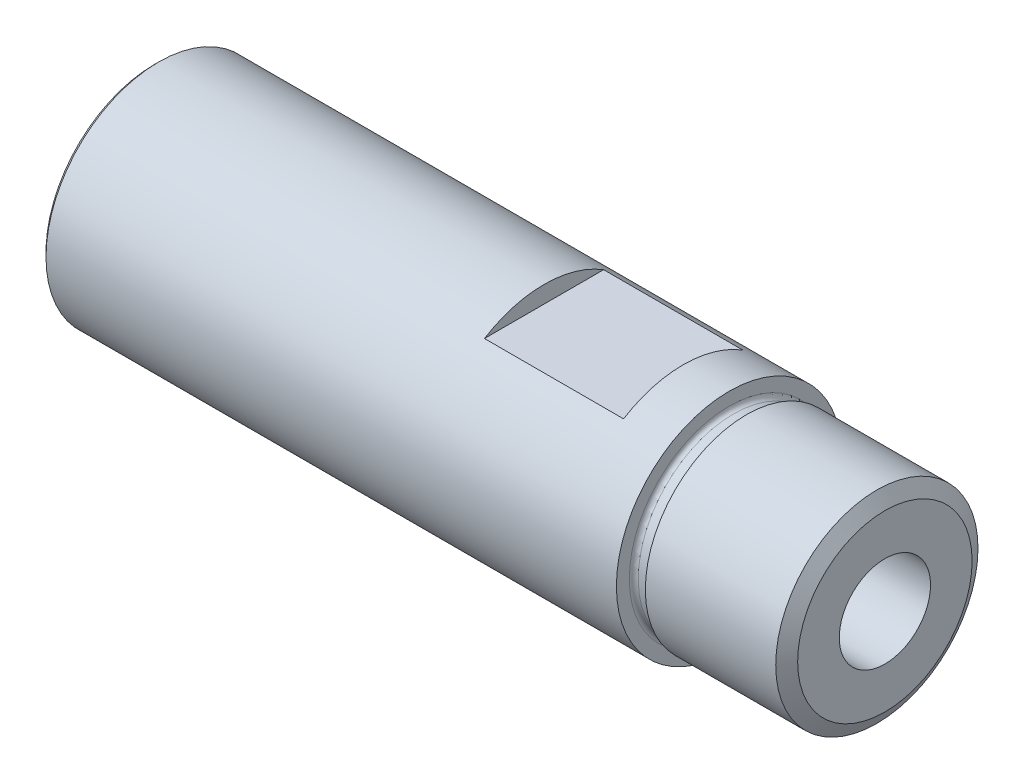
ISO-10303-21;
HEADER;
FILE_DESCRIPTION(('STEP AP214'),'2;1');
FILE_NAME('part.step','',(''),(''),'','','');
FILE_SCHEMA(('AUTOMOTIVE_DESIGN { 1 0 10303 214 1 1 1 1 }'));
ENDSEC;
DATA;
#1=APPLICATION_CONTEXT('core data for automotive mechanical design processes');
#2=APPLICATION_PROTOCOL_DEFINITION('international standard','automotive_design',2000,#1);
#3=PRODUCT_CONTEXT('',#1,'mechanical');
#4=PRODUCT('Part','Part','',(#3));
#5=PRODUCT_RELATED_PRODUCT_CATEGORY('part','',(#4));
#6=PRODUCT_DEFINITION_FORMATION('','',#4);
#7=PRODUCT_DEFINITION_CONTEXT('part definition',#1,'design');
#8=PRODUCT_DEFINITION('design','',#6,#7);
#9=PRODUCT_DEFINITION_SHAPE('','',#8);
#10=(LENGTH_UNIT() NAMED_UNIT(*) SI_UNIT(.MILLI.,.METRE.));
#11=(NAMED_UNIT(*) PLANE_ANGLE_UNIT() SI_UNIT($,.RADIAN.));
#12=(NAMED_UNIT(*) SI_UNIT($,.STERADIAN.) SOLID_ANGLE_UNIT());
#13=UNCERTAINTY_MEASURE_WITH_UNIT(LENGTH_MEASURE(1.E-05),#10,'distance_accuracy_value','');
#14=(GEOMETRIC_REPRESENTATION_CONTEXT(3) GLOBAL_UNCERTAINTY_ASSIGNED_CONTEXT((#13)) GLOBAL_UNIT_ASSIGNED_CONTEXT((#10,
#11,#12)) REPRESENTATION_CONTEXT('',''));
#15=CARTESIAN_POINT('',(0.,0.,0.));
#16=DIRECTION('',(0.,0.,1.));
#17=DIRECTION('',(1.,0.,0.));
#18=AXIS2_PLACEMENT_3D('',#15,#16,#17);
#19=CARTESIAN_POINT('',(133.35,20.574,0.));
#20=DIRECTION('',(1.,0.,0.));
#21=DIRECTION('',(0.,1.,0.));
#22=AXIS2_PLACEMENT_3D('',#19,#20,#21);
#23=PLANE('',#22);
#24=CARTESIAN_POINT('',(133.35,0.,0.));
#25=DIRECTION('',(1.,0.,0.));
#26=DIRECTION('',(0.,1.,0.));
#27=AXIS2_PLACEMENT_3D('',#24,#25,#26);
#28=CIRCLE('',#27,15.9258);
#29=CARTESIAN_POINT('',(133.35,15.9258,0.));
#30=VERTEX_POINT('',#29);
#31=EDGE_CURVE('E112',#30,#30,#28,.T.);
#32=ORIENTED_EDGE('',*,*,#31,.T.);
#33=EDGE_LOOP('',(#32));
#34=FACE_BOUND('',#33,.T.);
#35=CARTESIAN_POINT('',(133.35,0.,0.));
#36=DIRECTION('',(1.,0.,0.));
#37=DIRECTION('',(0.,0.,-1.));
#38=AXIS2_PLACEMENT_3D('',#35,#36,#37);
#39=CIRCLE('',#38,8.33374);
#40=CARTESIAN_POINT('',(133.35,0.,-8.33374));
#41=VERTEX_POINT('',#40);
#42=EDGE_CURVE('E184',#41,#41,#39,.T.);
#43=ORIENTED_EDGE('',*,*,#42,.F.);
#44=EDGE_LOOP('',(#43));
#45=FACE_BOUND('',#44,.T.);
#46=ADVANCED_FACE('F42',(#34,#45),#23,.T.);
#47=CARTESIAN_POINT('',(41.148,0.,0.));
#48=DIRECTION('',(-1.,0.,0.));
#49=DIRECTION('',(0.,0.,1.));
#50=AXIS2_PLACEMENT_3D('',#47,#48,#49);
#51=CONICAL_SURFACE('',#50,13.29563,1.02974425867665);
#52=CARTESIAN_POINT('',(41.148,0.,0.));
#53=DIRECTION('',(-1.,0.,0.));
#54=DIRECTION('',(0.,0.,1.));
#55=AXIS2_PLACEMENT_3D('',#52,#53,#54);
#56=CIRCLE('',#55,13.29563);
#57=CARTESIAN_POINT('',(41.148,0.,13.29563));
#58=VERTEX_POINT('',#57);
#59=EDGE_CURVE('E146',#58,#58,#56,.T.);
#60=ORIENTED_EDGE('',*,*,#59,.T.);
#61=EDGE_LOOP('',(#60));
#62=FACE_BOUND('',#61,.T.);
#63=CARTESIAN_POINT('',(41.2769627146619,0.,0.));
#64=DIRECTION('',(-1.,0.,0.));
#65=DIRECTION('',(0.,0.,1.));
#66=AXIS2_PLACEMENT_3D('',#63,#64,#65);
#67=CIRCLE('',#66,13.081);
#68=CARTESIAN_POINT('',(41.2769627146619,0.,13.081));
#69=VERTEX_POINT('',#68);
#70=EDGE_CURVE('E147',#69,#69,#67,.T.);
#71=ORIENTED_EDGE('',*,*,#70,.F.);
#72=EDGE_LOOP('',(#71));
#73=FACE_BOUND('',#72,.T.);
#74=ADVANCED_FACE('F206',(#62,#73),#51,.F.);
#75=CARTESIAN_POINT('',(0.,0.,0.));
#76=DIRECTION('',(-1.,0.,0.));
#77=DIRECTION('',(0.,-1.,0.));
#78=AXIS2_PLACEMENT_3D('',#75,#76,#77);
#79=PLANE('',#78);
#80=CARTESIAN_POINT('',(0.,0.,0.));
#81=DIRECTION('',(-1.,0.,0.));
#82=DIRECTION('',(0.,-1.,0.));
#83=AXIS2_PLACEMENT_3D('',#80,#81,#82);
#84=CIRCLE('',#83,19.812);
#85=CARTESIAN_POINT('',(0.,19.812,0.));
#86=VERTEX_POINT('',#85);
#87=EDGE_CURVE('E106',#86,#86,#84,.T.);
#88=ORIENTED_EDGE('',*,*,#87,.T.);
#89=EDGE_LOOP('',(#88));
#90=FACE_BOUND('',#89,.T.);
#91=CARTESIAN_POINT('',(0.,0.,0.));
#92=DIRECTION('',(-1.,0.,0.));
#93=DIRECTION('',(0.,-1.,0.));
#94=AXIS2_PLACEMENT_3D('',#91,#92,#93);
#95=CIRCLE('',#94,15.561081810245);
#96=CARTESIAN_POINT('',(0.,-15.561081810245,0.));
#97=VERTEX_POINT('',#96);
#98=EDGE_CURVE('E118',#97,#97,#95,.F.);
#99=ORIENTED_EDGE('',*,*,#98,.T.);
#100=EDGE_LOOP('',(#99));
#101=FACE_BOUND('',#100,.T.);
#102=ADVANCED_FACE('F44',(#90,#101),#79,.T.);
#103=CARTESIAN_POINT('',(133.35,0.,0.));
#104=DIRECTION('',(1.,0.,0.));
#105=DIRECTION('',(0.,1.,0.));
#106=AXIS2_PLACEMENT_3D('',#103,#104,#105);
#107=CYLINDRICAL_SURFACE('',#106,20.574);
#108=CARTESIAN_POINT('',(71.12,0.,0.));
#109=DIRECTION('',(-1.,0.,0.));
#110=DIRECTION('',(0.,0.,1.));
#111=AXIS2_PLACEMENT_3D('',#108,#109,#110);
#112=CIRCLE('',#111,20.574);
#113=CARTESIAN_POINT('',(71.12,-17.4625,10.8789048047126));
#114=VERTEX_POINT('',#113);
#115=CARTESIAN_POINT('',(71.12,-17.4625,-10.8789048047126));
#116=VERTEX_POINT('',#115);
#117=EDGE_CURVE('E12',#114,#116,#112,.F.);
#118=ORIENTED_EDGE('',*,*,#117,.F.);
#119=DIRECTION('',(1.,0.,0.));
#120=VECTOR('',#119,1.);
#121=CARTESIAN_POINT('',(133.35,-17.4625,10.8789048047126));
#122=LINE('',#121,#120);
#123=CARTESIAN_POINT('',(96.52,-17.4625,10.8789048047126));
#124=VERTEX_POINT('',#123);
#125=EDGE_CURVE('E50',#124,#114,#122,.F.);
#126=ORIENTED_EDGE('',*,*,#125,.F.);
#127=CARTESIAN_POINT('',(96.52,0.,0.));
#128=DIRECTION('',(1.,0.,0.));
#129=DIRECTION('',(0.,0.,-1.));
#130=AXIS2_PLACEMENT_3D('',#127,#128,#129);
#131=CIRCLE('',#130,20.574);
#132=CARTESIAN_POINT('',(96.52,-17.4625,-10.8789048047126));
#133=VERTEX_POINT('',#132);
#134=EDGE_CURVE('E80',#133,#124,#131,.F.);
#135=ORIENTED_EDGE('',*,*,#134,.F.);
#136=DIRECTION('',(1.,0.,0.));
#137=VECTOR('',#136,1.);
#138=CARTESIAN_POINT('',(133.35,-17.4625,-10.8789048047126));
#139=LINE('',#138,#137);
#140=EDGE_CURVE('E85',#116,#133,#139,.T.);
#141=ORIENTED_EDGE('',*,*,#140,.F.);
#142=EDGE_LOOP('',(#118,#126,#135,#141));
#143=FACE_BOUND('',#142,.T.);
#144=DIRECTION('',(1.,0.,0.));
#145=VECTOR('',#144,1.);
#146=CARTESIAN_POINT('',(133.35,17.4625,-10.8789048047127));
#147=LINE('',#146,#145);
#148=CARTESIAN_POINT('',(96.52,17.4625,-10.8789048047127));
#149=VERTEX_POINT('',#148);
#150=CARTESIAN_POINT('',(71.12,17.4625,-10.8789048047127));
#151=VERTEX_POINT('',#150);
#152=EDGE_CURVE('E86',#149,#151,#147,.F.);
#153=ORIENTED_EDGE('',*,*,#152,.F.);
#154=CARTESIAN_POINT('',(96.52,0.,0.));
#155=DIRECTION('',(1.,0.,0.));
#156=DIRECTION('',(0.,0.,-1.));
#157=AXIS2_PLACEMENT_3D('',#154,#155,#156);
#158=CIRCLE('',#157,20.574);
#159=CARTESIAN_POINT('',(96.52,17.4625,10.8789048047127));
#160=VERTEX_POINT('',#159);
#161=EDGE_CURVE('E102',#160,#149,#158,.F.);
#162=ORIENTED_EDGE('',*,*,#161,.F.);
#163=DIRECTION('',(1.,0.,0.));
#164=VECTOR('',#163,1.);
#165=CARTESIAN_POINT('',(133.35,17.4625,10.8789048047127));
#166=LINE('',#165,#164);
#167=CARTESIAN_POINT('',(71.12,17.4625,10.8789048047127));
#168=VERTEX_POINT('',#167);
#169=EDGE_CURVE('E104',#168,#160,#166,.T.);
#170=ORIENTED_EDGE('',*,*,#169,.F.);
#171=CARTESIAN_POINT('',(71.12,0.,0.));
#172=DIRECTION('',(-1.,0.,0.));
#173=DIRECTION('',(0.,0.,1.));
#174=AXIS2_PLACEMENT_3D('',#171,#172,#173);
#175=CIRCLE('',#174,20.574);
#176=EDGE_CURVE('E100',#151,#168,#175,.F.);
#177=ORIENTED_EDGE('',*,*,#176,.F.);
#178=EDGE_LOOP('',(#153,#162,#170,#177));
#179=FACE_BOUND('',#178,.T.);
#180=CARTESIAN_POINT('',(0.762000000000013,0.,0.));
#181=DIRECTION('',(-1.,0.,0.));
#182=DIRECTION('',(0.,-1.,0.));
#183=AXIS2_PLACEMENT_3D('',#180,#181,#182);
#184=CIRCLE('',#183,20.574);
#185=CARTESIAN_POINT('',(0.762000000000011,20.574,0.));
#186=VERTEX_POINT('',#185);
#187=EDGE_CURVE('E109',#186,#186,#184,.F.);
#188=ORIENTED_EDGE('',*,*,#187,.T.);
#189=EDGE_LOOP('',(#188));
#190=FACE_BOUND('',#189,.T.);
#191=CARTESIAN_POINT('',(104.902,0.,0.));
#192=DIRECTION('',(-1.,0.,0.));
#193=DIRECTION('',(0.,-1.,0.));
#194=AXIS2_PLACEMENT_3D('',#191,#192,#193);
#195=CIRCLE('',#194,20.574);
#196=CARTESIAN_POINT('',(104.902,-20.574,0.));
#197=VERTEX_POINT('',#196);
#198=EDGE_CURVE('E136',#197,#197,#195,.F.);
#199=ORIENTED_EDGE('',*,*,#198,.F.);
#200=EDGE_LOOP('',(#199));
#201=FACE_BOUND('',#200,.T.);
#202=ADVANCED_FACE('F95',(#143,#179,#190,#201),#107,.T.);
#203=CARTESIAN_POINT('',(14.5928680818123,0.,0.));
#204=DIRECTION('',(-1.,0.,0.));
#205=DIRECTION('',(0.,-1.,0.));
#206=AXIS2_PLACEMENT_3D('',#203,#204,#205);
#207=CONICAL_SURFACE('',#206,12.7883319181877,0.785398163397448);
#208=CARTESIAN_POINT('',(12.7,0.,0.));
#209=DIRECTION('',(1.,0.,0.));
#210=DIRECTION('',(0.,1.,0.));
#211=AXIS2_PLACEMENT_3D('',#208,#209,#210);
#212=CIRCLE('',#211,14.6812);
#213=CARTESIAN_POINT('',(12.7,14.6812,0.));
#214=VERTEX_POINT('',#213);
#215=EDGE_CURVE('E150',#214,#214,#212,.T.);
#216=ORIENTED_EDGE('',*,*,#215,.F.);
#217=EDGE_LOOP('',(#216));
#218=FACE_BOUND('',#217,.T.);
#219=CARTESIAN_POINT('',(14.08557,0.,0.));
#220=DIRECTION('',(-1.,0.,0.));
#221=DIRECTION('',(0.,-1.,0.));
#222=AXIS2_PLACEMENT_3D('',#219,#220,#221);
#223=CIRCLE('',#222,13.29563);
#224=CARTESIAN_POINT('',(14.08557,-13.29563,0.));
#225=VERTEX_POINT('',#224);
#226=EDGE_CURVE('E152',#225,#225,#223,.T.);
#227=ORIENTED_EDGE('',*,*,#226,.F.);
#228=EDGE_LOOP('',(#227));
#229=FACE_BOUND('',#228,.T.);
#230=ADVANCED_FACE('F218',(#218,#229),#207,.F.);
#231=CARTESIAN_POINT('',(14.5928680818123,0.,0.));
#232=DIRECTION('',(1.,0.,0.));
#233=DIRECTION('',(0.,1.,0.));
#234=AXIS2_PLACEMENT_3D('',#231,#232,#233);
#235=CYLINDRICAL_SURFACE('',#234,14.6812);
#236=CARTESIAN_POINT('',(1.52399999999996,0.,0.));
#237=DIRECTION('',(-1.,0.,0.));
#238=DIRECTION('',(0.,-1.,0.));
#239=AXIS2_PLACEMENT_3D('',#236,#237,#238);
#240=CIRCLE('',#239,14.6812);
#241=CARTESIAN_POINT('',(1.52399999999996,-14.6812,0.));
#242=VERTEX_POINT('',#241);
#243=EDGE_CURVE('E121',#242,#242,#240,.T.);
#244=ORIENTED_EDGE('',*,*,#243,.T.);
#245=EDGE_LOOP('',(#244));
#246=FACE_BOUND('',#245,.T.);
#247=ORIENTED_EDGE('',*,*,#215,.T.);
#248=EDGE_LOOP('',(#247));
#249=FACE_BOUND('',#248,.T.);
#250=ADVANCED_FACE('F223',(#246,#249),#235,.F.);
#251=CARTESIAN_POINT('',(0.,0.,0.));
#252=DIRECTION('',(-1.,0.,0.));
#253=DIRECTION('',(0.,0.,1.));
#254=AXIS2_PLACEMENT_3D('',#251,#252,#253);
#255=CYLINDRICAL_SURFACE('',#254,13.29563);
#256=ORIENTED_EDGE('',*,*,#226,.T.);
#257=EDGE_LOOP('',(#256));
#258=FACE_BOUND('',#257,.T.);
#259=ORIENTED_EDGE('',*,*,#59,.F.);
#260=EDGE_LOOP('',(#259));
#261=FACE_BOUND('',#260,.T.);
#262=ADVANCED_FACE('F216',(#258,#261),#255,.F.);
#263=CARTESIAN_POINT('',(64.516,0.,0.));
#264=DIRECTION('',(-1.,0.,0.));
#265=DIRECTION('',(0.,0.,1.));
#266=AXIS2_PLACEMENT_3D('',#263,#264,#265);
#267=CYLINDRICAL_SURFACE('',#266,13.081);
#268=CARTESIAN_POINT('',(63.754,0.,0.));
#269=DIRECTION('',(1.,0.,0.));
#270=DIRECTION('',(0.,0.,-1.));
#271=AXIS2_PLACEMENT_3D('',#268,#269,#270);
#272=CIRCLE('',#271,13.081);
#273=CARTESIAN_POINT('',(63.754,0.,-13.081));
#274=VERTEX_POINT('',#273);
#275=EDGE_CURVE('E143',#274,#274,#272,.T.);
#276=ORIENTED_EDGE('',*,*,#275,.T.);
#277=EDGE_LOOP('',(#276));
#278=FACE_BOUND('',#277,.T.);
#279=ORIENTED_EDGE('',*,*,#70,.T.);
#280=EDGE_LOOP('',(#279));
#281=FACE_BOUND('',#280,.T.);
#282=ADVANCED_FACE('F250',(#278,#281),#267,.F.);
#283=CARTESIAN_POINT('',(64.516,0.,0.));
#284=DIRECTION('',(1.,0.,0.));
#285=DIRECTION('',(0.,0.,-1.));
#286=AXIS2_PLACEMENT_3D('',#283,#284,#285);
#287=PLANE('',#286);
#288=CARTESIAN_POINT('',(64.516,0.,0.));
#289=DIRECTION('',(1.,0.,0.));
#290=DIRECTION('',(0.,0.,-1.));
#291=AXIS2_PLACEMENT_3D('',#288,#289,#290);
#292=CIRCLE('',#291,8.01623999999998);
#293=CARTESIAN_POINT('',(64.516,0.,-8.01623999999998));
#294=VERTEX_POINT('',#293);
#295=EDGE_CURVE('E124',#294,#294,#292,.T.);
#296=ORIENTED_EDGE('',*,*,#295,.T.);
#297=EDGE_LOOP('',(#296));
#298=FACE_BOUND('',#297,.T.);
#299=CARTESIAN_POINT('',(64.516,0.,0.));
#300=DIRECTION('',(1.,0.,0.));
#301=DIRECTION('',(0.,0.,-1.));
#302=AXIS2_PLACEMENT_3D('',#299,#300,#301);
#303=CIRCLE('',#302,12.319);
#304=CARTESIAN_POINT('',(64.516,0.,-12.319));
#305=VERTEX_POINT('',#304);
#306=EDGE_CURVE('E130',#305,#305,#303,.F.);
#307=ORIENTED_EDGE('',*,*,#306,.T.);
#308=EDGE_LOOP('',(#307));
#309=FACE_BOUND('',#308,.T.);
#310=ADVANCED_FACE('F256',(#298,#309),#287,.F.);
#311=CARTESIAN_POINT('',(63.754,0.,0.));
#312=DIRECTION('',(1.,0.,0.));
#313=DIRECTION('',(0.,0.,-1.));
#314=AXIS2_PLACEMENT_3D('',#311,#312,#313);
#315=TOROIDAL_SURFACE('',#314,12.319,0.762);
#316=ORIENTED_EDGE('',*,*,#306,.F.);
#317=EDGE_LOOP('',(#316));
#318=FACE_BOUND('',#317,.T.);
#319=ORIENTED_EDGE('',*,*,#275,.F.);
#320=EDGE_LOOP('',(#319));
#321=FACE_BOUND('',#320,.T.);
#322=ADVANCED_FACE('F262',(#318,#321),#315,.F.);
#323=CARTESIAN_POINT('',(64.516,0.,0.));
#324=DIRECTION('',(-1.,0.,0.));
#325=DIRECTION('',(0.,0.,1.));
#326=AXIS2_PLACEMENT_3D('',#323,#324,#325);
#327=CYLINDRICAL_SURFACE('',#326,6.74623999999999);
#328=CARTESIAN_POINT('',(65.786,0.,0.));
#329=DIRECTION('',(1.,0.,0.));
#330=DIRECTION('',(0.,0.,-1.));
#331=AXIS2_PLACEMENT_3D('',#328,#329,#330);
#332=CIRCLE('',#331,6.74623999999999);
#333=CARTESIAN_POINT('',(65.786,0.,-6.74623999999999));
#334=VERTEX_POINT('',#333);
#335=EDGE_CURVE('E127',#334,#334,#332,.F.);
#336=ORIENTED_EDGE('',*,*,#335,.T.);
#337=EDGE_LOOP('',(#336));
#338=FACE_BOUND('',#337,.T.);
#339=CARTESIAN_POINT('',(88.138,0.,0.));
#340=DIRECTION('',(-1.,0.,0.));
#341=DIRECTION('',(0.,-1.,0.));
#342=AXIS2_PLACEMENT_3D('',#339,#340,#341);
#343=CIRCLE('',#342,6.74623999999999);
#344=CARTESIAN_POINT('',(88.138,-6.74623999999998,0.));
#345=VERTEX_POINT('',#344);
#346=EDGE_CURVE('E151',#345,#345,#343,.T.);
#347=ORIENTED_EDGE('',*,*,#346,.F.);
#348=EDGE_LOOP('',(#347));
#349=FACE_BOUND('',#348,.T.);
#350=ADVANCED_FACE('F268',(#338,#349),#327,.F.);
#351=CARTESIAN_POINT('',(88.8433719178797,0.,0.));
#352=DIRECTION('',(-1.,0.,0.));
#353=DIRECTION('',(0.,-1.,0.));
#354=AXIS2_PLACEMENT_3D('',#351,#352,#353);
#355=CONICAL_SURFACE('',#354,5.52449999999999,1.04719755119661);
#356=ORIENTED_EDGE('',*,*,#346,.T.);
#357=EDGE_LOOP('',(#356));
#358=FACE_BOUND('',#357,.T.);
#359=CARTESIAN_POINT('',(88.8433719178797,0.,0.));
#360=DIRECTION('',(-1.,0.,0.));
#361=DIRECTION('',(0.,-1.,0.));
#362=AXIS2_PLACEMENT_3D('',#359,#360,#361);
#363=CIRCLE('',#362,5.52449999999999);
#364=CARTESIAN_POINT('',(88.8433719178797,-5.52449999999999,0.));
#365=VERTEX_POINT('',#364);
#366=EDGE_CURVE('E161',#365,#365,#363,.T.);
#367=ORIENTED_EDGE('',*,*,#366,.F.);
#368=EDGE_LOOP('',(#367));
#369=FACE_BOUND('',#368,.T.);
#370=ADVANCED_FACE('F272',(#358,#369),#355,.F.);
#371=CARTESIAN_POINT('',(90.1631946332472,0.,0.));
#372=DIRECTION('',(-1.,0.,0.));
#373=DIRECTION('',(0.,-1.,0.));
#374=AXIS2_PLACEMENT_3D('',#371,#372,#373);
#375=TOROIDAL_SURFACE('',#374,6.2865,1.52400000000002);
#376=ORIENTED_EDGE('',*,*,#366,.T.);
#377=EDGE_LOOP('',(#376));
#378=FACE_BOUND('',#377,.T.);
#379=CARTESIAN_POINT('',(90.1631946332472,0.,0.));
#380=DIRECTION('',(-1.,0.,0.));
#381=DIRECTION('',(0.,-1.,0.));
#382=AXIS2_PLACEMENT_3D('',#379,#380,#381);
#383=CIRCLE('',#382,4.76249999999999);
#384=CARTESIAN_POINT('',(90.1631946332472,-4.76249999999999,0.));
#385=VERTEX_POINT('',#384);
#386=EDGE_CURVE('E139',#385,#385,#383,.T.);
#387=ORIENTED_EDGE('',*,*,#386,.F.);
#388=EDGE_LOOP('',(#387));
#389=FACE_BOUND('',#388,.T.);
#390=ADVANCED_FACE('F276',(#378,#389),#375,.T.);
#391=CARTESIAN_POINT('',(0.,0.,0.));
#392=DIRECTION('',(-1.,0.,0.));
#393=DIRECTION('',(0.,-1.,0.));
#394=AXIS2_PLACEMENT_3D('',#391,#392,#393);
#395=CYLINDRICAL_SURFACE('',#394,4.76249999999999);
#396=CARTESIAN_POINT('',(108.458,0.,0.));
#397=DIRECTION('',(1.,0.,0.));
#398=DIRECTION('',(0.,1.,0.));
#399=AXIS2_PLACEMENT_3D('',#396,#397,#398);
#400=CIRCLE('',#399,4.76250000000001);
#401=CARTESIAN_POINT('',(108.458,4.76250000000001,0.));
#402=VERTEX_POINT('',#401);
#403=EDGE_CURVE('E177',#402,#402,#400,.T.);
#404=ORIENTED_EDGE('',*,*,#403,.T.);
#405=EDGE_LOOP('',(#404));
#406=FACE_BOUND('',#405,.T.);
#407=ORIENTED_EDGE('',*,*,#386,.T.);
#408=EDGE_LOOP('',(#407));
#409=FACE_BOUND('',#408,.T.);
#410=ADVANCED_FACE('F280',(#406,#409),#395,.F.);
#411=CARTESIAN_POINT('',(105.7148,0.,0.));
#412=DIRECTION('',(1.,0.,0.));
#413=DIRECTION('',(0.,1.,0.));
#414=AXIS2_PLACEMENT_3D('',#411,#412,#413);
#415=TOROIDAL_SURFACE('',#414,18.2118,0.812800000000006);
#416=CARTESIAN_POINT('',(105.7148,0.,0.));
#417=DIRECTION('',(1.,0.,0.));
#418=DIRECTION('',(0.,1.,0.));
#419=AXIS2_PLACEMENT_3D('',#416,#417,#418);
#420=CIRCLE('',#419,17.399);
#421=CARTESIAN_POINT('',(105.7148,17.399,0.));
#422=VERTEX_POINT('',#421);
#423=EDGE_CURVE('E174',#422,#422,#420,.T.);
#424=ORIENTED_EDGE('',*,*,#423,.F.);
#425=EDGE_LOOP('',(#424));
#426=FACE_BOUND('',#425,.T.);
#427=CARTESIAN_POINT('',(104.902,0.,0.));
#428=DIRECTION('',(1.,0.,0.));
#429=DIRECTION('',(0.,1.,0.));
#430=AXIS2_PLACEMENT_3D('',#427,#428,#429);
#431=CIRCLE('',#430,18.2118);
#432=CARTESIAN_POINT('',(104.902,18.2118,0.));
#433=VERTEX_POINT('',#432);
#434=EDGE_CURVE('E140',#433,#433,#431,.T.);
#435=ORIENTED_EDGE('',*,*,#434,.T.);
#436=EDGE_LOOP('',(#435));
#437=FACE_BOUND('',#436,.T.);
#438=ADVANCED_FACE('F284',(#426,#437),#415,.F.);
#439=CARTESIAN_POINT('',(104.902,21.3041670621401,0.));
#440=DIRECTION('',(-1.,0.,0.));
#441=DIRECTION('',(0.,-1.,0.));
#442=AXIS2_PLACEMENT_3D('',#439,#440,#441);
#443=PLANE('',#442);
#444=ORIENTED_EDGE('',*,*,#198,.T.);
#445=EDGE_LOOP('',(#444));
#446=FACE_BOUND('',#445,.T.);
#447=ORIENTED_EDGE('',*,*,#434,.F.);
#448=EDGE_LOOP('',(#447));
#449=FACE_BOUND('',#448,.T.);
#450=ADVANCED_FACE('F288',(#446,#449),#443,.F.);
#451=CARTESIAN_POINT('',(133.35,0.,0.));
#452=DIRECTION('',(1.,0.,0.));
#453=DIRECTION('',(0.,1.,0.));
#454=AXIS2_PLACEMENT_3D('',#451,#452,#453);
#455=CYLINDRICAL_SURFACE('',#454,18.4658);
#456=CARTESIAN_POINT('',(131.883530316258,0.,0.));
#457=DIRECTION('',(1.,0.,0.));
#458=DIRECTION('',(0.,1.,0.));
#459=AXIS2_PLACEMENT_3D('',#456,#457,#458);
#460=CIRCLE('',#459,18.4658);
#461=CARTESIAN_POINT('',(131.883530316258,18.4658,0.));
#462=VERTEX_POINT('',#461);
#463=EDGE_CURVE('E115',#462,#462,#460,.F.);
#464=ORIENTED_EDGE('',*,*,#463,.T.);
#465=EDGE_LOOP('',(#464));
#466=FACE_BOUND('',#465,.T.);
#467=CARTESIAN_POINT('',(108.077,0.,0.));
#468=DIRECTION('',(1.,0.,0.));
#469=DIRECTION('',(0.,1.,0.));
#470=AXIS2_PLACEMENT_3D('',#467,#468,#469);
#471=CIRCLE('',#470,18.4658);
#472=CARTESIAN_POINT('',(108.077,18.4658,0.));
#473=VERTEX_POINT('',#472);
#474=EDGE_CURVE('E168',#473,#473,#471,.T.);
#475=ORIENTED_EDGE('',*,*,#474,.T.);
#476=EDGE_LOOP('',(#475));
#477=FACE_BOUND('',#476,.T.);
#478=ADVANCED_FACE('F292',(#466,#477),#455,.T.);
#479=CARTESIAN_POINT('',(108.077,17.399,0.));
#480=DIRECTION('',(1.,0.,0.));
#481=DIRECTION('',(0.,1.,0.));
#482=AXIS2_PLACEMENT_3D('',#479,#480,#481);
#483=PLANE('',#482);
#484=ORIENTED_EDGE('',*,*,#474,.F.);
#485=EDGE_LOOP('',(#484));
#486=FACE_BOUND('',#485,.T.);
#487=CARTESIAN_POINT('',(108.077,0.,0.));
#488=DIRECTION('',(1.,0.,0.));
#489=DIRECTION('',(0.,1.,0.));
#490=AXIS2_PLACEMENT_3D('',#487,#488,#489);
#491=CIRCLE('',#490,17.399);
#492=CARTESIAN_POINT('',(108.077,17.399,0.));
#493=VERTEX_POINT('',#492);
#494=EDGE_CURVE('E171',#493,#493,#491,.T.);
#495=ORIENTED_EDGE('',*,*,#494,.T.);
#496=EDGE_LOOP('',(#495));
#497=FACE_BOUND('',#496,.T.);
#498=ADVANCED_FACE('F296',(#486,#497),#483,.F.);
#499=CARTESIAN_POINT('',(133.35,0.,0.));
#500=DIRECTION('',(1.,0.,0.));
#501=DIRECTION('',(0.,1.,0.));
#502=AXIS2_PLACEMENT_3D('',#499,#500,#501);
#503=CYLINDRICAL_SURFACE('',#502,17.399);
#504=ORIENTED_EDGE('',*,*,#494,.F.);
#505=EDGE_LOOP('',(#504));
#506=FACE_BOUND('',#505,.T.);
#507=ORIENTED_EDGE('',*,*,#423,.T.);
#508=EDGE_LOOP('',(#507));
#509=FACE_BOUND('',#508,.T.);
#510=ADVANCED_FACE('F300',(#506,#509),#503,.T.);
#511=CARTESIAN_POINT('',(111.633,0.,0.));
#512=DIRECTION('',(1.,0.,0.));
#513=DIRECTION('',(0.,1.,0.));
#514=AXIS2_PLACEMENT_3D('',#511,#512,#513);
#515=CONICAL_SURFACE('',#514,7.9375,0.785398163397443);
#516=ORIENTED_EDGE('',*,*,#403,.F.);
#517=EDGE_LOOP('',(#516));
#518=FACE_BOUND('',#517,.T.);
#519=CARTESIAN_POINT('',(111.633,0.,0.));
#520=DIRECTION('',(1.,0.,0.));
#521=DIRECTION('',(0.,1.,0.));
#522=AXIS2_PLACEMENT_3D('',#519,#520,#521);
#523=CIRCLE('',#522,7.9375);
#524=CARTESIAN_POINT('',(111.633,7.9375,0.));
#525=VERTEX_POINT('',#524);
#526=EDGE_CURVE('E134',#525,#525,#523,.T.);
#527=ORIENTED_EDGE('',*,*,#526,.T.);
#528=EDGE_LOOP('',(#527));
#529=FACE_BOUND('',#528,.T.);
#530=ADVANCED_FACE('F304',(#518,#529),#515,.F.);
#531=CARTESIAN_POINT('',(133.35,0.,0.));
#532=DIRECTION('',(1.,0.,0.));
#533=DIRECTION('',(0.,1.,0.));
#534=AXIS2_PLACEMENT_3D('',#531,#532,#533);
#535=CYLINDRICAL_SURFACE('',#534,7.93749999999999);
#536=CARTESIAN_POINT('',(114.061914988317,0.,0.));
#537=DIRECTION('',(1.,0.,0.));
#538=DIRECTION('',(0.,0.,-1.));
#539=AXIS2_PLACEMENT_3D('',#536,#537,#538);
#540=CIRCLE('',#539,7.93749999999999);
#541=CARTESIAN_POINT('',(114.061914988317,0.,-7.93749999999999));
#542=VERTEX_POINT('',#541);
#543=EDGE_CURVE('E131',#542,#542,#540,.T.);
#544=ORIENTED_EDGE('',*,*,#543,.T.);
#545=EDGE_LOOP('',(#544));
#546=FACE_BOUND('',#545,.T.);
#547=ORIENTED_EDGE('',*,*,#526,.F.);
#548=EDGE_LOOP('',(#547));
#549=FACE_BOUND('',#548,.T.);
#550=ADVANCED_FACE('F308',(#546,#549),#535,.F.);
#551=CARTESIAN_POINT('',(114.3,0.,0.));
#552=DIRECTION('',(1.,0.,0.));
#553=DIRECTION('',(0.,0.,-1.));
#554=AXIS2_PLACEMENT_3D('',#551,#552,#553);
#555=CONICAL_SURFACE('',#554,8.33373999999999,1.02974425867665);
#556=CARTESIAN_POINT('',(114.3,0.,0.));
#557=DIRECTION('',(1.,0.,0.));
#558=DIRECTION('',(0.,0.,-1.));
#559=AXIS2_PLACEMENT_3D('',#556,#557,#558);
#560=CIRCLE('',#559,8.33373999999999);
#561=CARTESIAN_POINT('',(114.3,0.,-8.33373999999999));
#562=VERTEX_POINT('',#561);
#563=EDGE_CURVE('E135',#562,#562,#560,.T.);
#564=ORIENTED_EDGE('',*,*,#563,.T.);
#565=EDGE_LOOP('',(#564));
#566=FACE_BOUND('',#565,.T.);
#567=ORIENTED_EDGE('',*,*,#543,.F.);
#568=EDGE_LOOP('',(#567));
#569=FACE_BOUND('',#568,.T.);
#570=ADVANCED_FACE('F312',(#566,#569),#555,.F.);
#571=CARTESIAN_POINT('',(133.35,0.,0.));
#572=DIRECTION('',(1.,0.,0.));
#573=DIRECTION('',(0.,0.,-1.));
#574=AXIS2_PLACEMENT_3D('',#571,#572,#573);
#575=CYLINDRICAL_SURFACE('',#574,8.33374);
#576=ORIENTED_EDGE('',*,*,#563,.F.);
#577=EDGE_LOOP('',(#576));
#578=FACE_BOUND('',#577,.T.);
#579=ORIENTED_EDGE('',*,*,#42,.T.);
#580=EDGE_LOOP('',(#579));
#581=FACE_BOUND('',#580,.T.);
#582=ADVANCED_FACE('F316',(#578,#581),#575,.F.);
#583=CARTESIAN_POINT('',(65.786,0.,0.));
#584=DIRECTION('',(-1.,0.,0.));
#585=DIRECTION('',(0.,0.,1.));
#586=AXIS2_PLACEMENT_3D('',#583,#584,#585);
#587=CONICAL_SURFACE('',#586,6.74623999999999,0.785398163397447);
#588=ORIENTED_EDGE('',*,*,#295,.F.);
#589=EDGE_LOOP('',(#588));
#590=FACE_BOUND('',#589,.T.);
#591=ORIENTED_EDGE('',*,*,#335,.F.);
#592=EDGE_LOOP('',(#591));
#593=FACE_BOUND('',#592,.T.);
#594=ADVANCED_FACE('F237',(#590,#593),#587,.F.);
#595=CARTESIAN_POINT('',(1.52399999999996,0.,0.));
#596=DIRECTION('',(-1.,0.,0.));
#597=DIRECTION('',(0.,-1.,0.));
#598=AXIS2_PLACEMENT_3D('',#595,#596,#597);
#599=CONICAL_SURFACE('',#598,14.6812,0.523598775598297);
#600=CARTESIAN_POINT('',(0.,-15.561081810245,0.));
#601=CARTESIAN_POINT('',(0.0158750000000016,-15.5519163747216,0.));
#602=CARTESIAN_POINT('',(0.0317500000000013,-15.5427509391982,0.));
#603=CARTESIAN_POINT('',(0.0635000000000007,-15.5244200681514,0.));
#604=CARTESIAN_POINT('',(0.0793750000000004,-15.515254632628,0.));
#605=CARTESIAN_POINT('',(0.111124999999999,-15.4969237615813,0.));
#606=CARTESIAN_POINT('',(0.126999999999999,-15.4877583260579,0.));
#607=CARTESIAN_POINT('',(0.158749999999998,-15.4694274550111,0.));
#608=CARTESIAN_POINT('',(0.174624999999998,-15.4602620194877,0.));
#609=CARTESIAN_POINT('',(0.206374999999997,-15.441931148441,0.));
#610=CARTESIAN_POINT('',(0.222249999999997,-15.4327657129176,0.));
#611=CARTESIAN_POINT('',(0.253999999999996,-15.4144348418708,0.));
#612=CARTESIAN_POINT('',(0.269874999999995,-15.4052694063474,0.));
#613=CARTESIAN_POINT('',(0.301624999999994,-15.3869385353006,0.));
#614=CARTESIAN_POINT('',(0.317499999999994,-15.3777730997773,0.));
#615=CARTESIAN_POINT('',(0.349249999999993,-15.3594422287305,0.));
#616=CARTESIAN_POINT('',(0.365124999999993,-15.3502767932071,0.));
#617=CARTESIAN_POINT('',(0.396874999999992,-15.3319459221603,0.));
#618=CARTESIAN_POINT('',(0.412749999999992,-15.3227804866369,0.));
#619=CARTESIAN_POINT('',(0.444499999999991,-15.3044496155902,0.));
#620=CARTESIAN_POINT('',(0.460374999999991,-15.2952841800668,0.));
#621=CARTESIAN_POINT('',(0.49212499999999,-15.27695330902,0.));
#622=CARTESIAN_POINT('',(0.507999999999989,-15.2677878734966,0.));
#623=CARTESIAN_POINT('',(0.539749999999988,-15.2494570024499,0.));
#624=CARTESIAN_POINT('',(0.555624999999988,-15.2402915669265,0.));
#625=CARTESIAN_POINT('',(0.587374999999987,-15.2219606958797,0.));
#626=CARTESIAN_POINT('',(0.603249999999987,-15.2127952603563,0.));
#627=CARTESIAN_POINT('',(0.634999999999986,-15.1944643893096,0.));
#628=CARTESIAN_POINT('',(0.650874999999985,-15.1852989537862,0.));
#629=CARTESIAN_POINT('',(0.682624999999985,-15.1669680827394,0.));
#630=CARTESIAN_POINT('',(0.698499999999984,-15.157802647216,0.));
#631=CARTESIAN_POINT('',(0.730249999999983,-15.1394717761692,0.));
#632=CARTESIAN_POINT('',(0.746124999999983,-15.1303063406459,0.));
#633=CARTESIAN_POINT('',(0.777874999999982,-15.1119754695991,0.));
#634=CARTESIAN_POINT('',(0.793749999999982,-15.1028100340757,0.));
#635=CARTESIAN_POINT('',(0.825499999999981,-15.0844791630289,0.));
#636=CARTESIAN_POINT('',(0.841374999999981,-15.0753137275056,0.));
#637=CARTESIAN_POINT('',(0.87312499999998,-15.0569828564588,0.));
#638=CARTESIAN_POINT('',(0.888999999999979,-15.0478174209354,0.));
#639=CARTESIAN_POINT('',(0.920749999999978,-15.0294865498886,0.));
#640=CARTESIAN_POINT('',(0.936624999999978,-15.0203211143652,0.));
#641=CARTESIAN_POINT('',(0.968374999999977,-15.0019902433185,0.));
#642=CARTESIAN_POINT('',(0.984249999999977,-14.9928248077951,0.));
#643=CARTESIAN_POINT('',(1.01599999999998,-14.9744939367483,0.));
#644=CARTESIAN_POINT('',(1.03187499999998,-14.9653285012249,0.));
#645=CARTESIAN_POINT('',(1.06362499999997,-14.9469976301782,0.));
#646=CARTESIAN_POINT('',(1.07949999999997,-14.9378321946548,0.));
#647=CARTESIAN_POINT('',(1.11124999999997,-14.919501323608,0.));
#648=CARTESIAN_POINT('',(1.12712499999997,-14.9103358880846,0.));
#649=CARTESIAN_POINT('',(1.15887499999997,-14.8920050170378,0.));
#650=CARTESIAN_POINT('',(1.17474999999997,-14.8828395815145,0.));
#651=CARTESIAN_POINT('',(1.20649999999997,-14.8645087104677,0.));
#652=CARTESIAN_POINT('',(1.22237499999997,-14.8553432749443,0.));
#653=CARTESIAN_POINT('',(1.25412499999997,-14.8370124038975,0.));
#654=CARTESIAN_POINT('',(1.26999999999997,-14.8278469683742,0.));
#655=CARTESIAN_POINT('',(1.30174999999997,-14.8095160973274,0.));
#656=CARTESIAN_POINT('',(1.31762499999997,-14.800350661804,0.));
#657=CARTESIAN_POINT('',(1.34937499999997,-14.7820197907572,0.));
#658=CARTESIAN_POINT('',(1.36524999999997,-14.7728543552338,0.));
#659=CARTESIAN_POINT('',(1.39699999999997,-14.7545234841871,0.));
#660=CARTESIAN_POINT('',(1.41287499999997,-14.7453580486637,0.));
#661=CARTESIAN_POINT('',(1.44462499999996,-14.7270271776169,0.));
#662=CARTESIAN_POINT('',(1.46049999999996,-14.7178617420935,0.));
#663=CARTESIAN_POINT('',(1.49224999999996,-14.6995308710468,0.));
#664=CARTESIAN_POINT('',(1.50812499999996,-14.6903654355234,0.));
#665=CARTESIAN_POINT('',(1.52399999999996,-14.6812,0.));
#666=B_SPLINE_CURVE_WITH_KNOTS('',3,(#600,#601,#602,#603,#604,#605,#606,#607,#608,#609,#610,
#611,#612,#613,#614,#615,#616,#617,#618,#619,#620,#621,#622,#623,#624,#625,#626,#627,#628,#629,
#630,#631,#632,#633,#634,#635,#636,#637,#638,#639,#640,#641,#642,#643,#644,#645,#646,#647,#648,
#649,#650,#651,#652,#653,#654,#655,#656,#657,#658,#659,#660,#661,#662,#663,#664,#665),
.UNSPECIFIED.,.F.,.F.,(4,2,2,2,2,2,2,2,2,2,2,2,2,2,2,2,2,2,2,2,2,2,2,2,2,2,2,2,2,2,2,2,4),(0.,
0.0549926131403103,0.109985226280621,0.164977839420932,0.219970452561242,0.274963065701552,
0.329955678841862,0.384948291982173,0.439940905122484,0.494933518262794,0.549926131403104,
0.604918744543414,0.659911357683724,0.714903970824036,0.769896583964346,0.824889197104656,
0.879881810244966,0.934874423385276,0.989867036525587,1.0448596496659,1.09985226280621,
1.15484487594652,1.20983748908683,1.26483010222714,1.31982271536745,1.37481532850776,
1.42980794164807,1.48480055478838,1.53979316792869,1.594785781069,1.64977839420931,
1.70477100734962,1.75976362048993),.UNSPECIFIED.);
#667=EDGE_CURVE('BSEAM233',#97,#242,#666,.T.);
#668=ORIENTED_EDGE('',*,*,#98,.F.);
#669=ORIENTED_EDGE('',*,*,#243,.F.);
#670=ORIENTED_EDGE('',*,*,#667,.T.);
#671=ORIENTED_EDGE('',*,*,#667,.F.);
#672=EDGE_LOOP('',(#668,#670,#669,#671));
#673=FACE_BOUND('',#672,.T.);
#674=ADVANCED_FACE('F233',(#673),#599,.F.);
#675=CARTESIAN_POINT('',(131.883530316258,0.,0.));
#676=DIRECTION('',(-1.,0.,0.));
#677=DIRECTION('',(0.,-1.,0.));
#678=AXIS2_PLACEMENT_3D('',#675,#676,#677);
#679=CONICAL_SURFACE('',#678,18.4658,1.04719755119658);
#680=ORIENTED_EDGE('',*,*,#31,.F.);
#681=EDGE_LOOP('',(#680));
#682=FACE_BOUND('',#681,.T.);
#683=ORIENTED_EDGE('',*,*,#463,.F.);
#684=EDGE_LOOP('',(#683));
#685=FACE_BOUND('',#684,.T.);
#686=ADVANCED_FACE('F236',(#682,#685),#679,.T.);
#687=CARTESIAN_POINT('',(0.762000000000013,0.,0.));
#688=DIRECTION('',(1.,0.,0.));
#689=DIRECTION('',(0.,1.,0.));
#690=AXIS2_PLACEMENT_3D('',#687,#688,#689);
#691=CONICAL_SURFACE('',#690,20.574,0.785398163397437);
#692=CARTESIAN_POINT('',(0.,19.812,0.));
#693=CARTESIAN_POINT('',(0.0079374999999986,19.8199375,0.));
#694=CARTESIAN_POINT('',(0.015874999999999,19.827875,0.));
#695=CARTESIAN_POINT('',(0.0317499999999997,19.84375,0.));
#696=CARTESIAN_POINT('',(0.0396875,19.8516875,0.));
#697=CARTESIAN_POINT('',(0.0555625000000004,19.8675625,0.));
#698=CARTESIAN_POINT('',(0.0635000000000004,19.8755,0.));
#699=CARTESIAN_POINT('',(0.0793750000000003,19.891375,0.));
#700=CARTESIAN_POINT('',(0.0873125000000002,19.8993125,0.));
#701=CARTESIAN_POINT('',(0.103187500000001,19.9151875,0.));
#702=CARTESIAN_POINT('',(0.111125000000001,19.923125,0.));
#703=CARTESIAN_POINT('',(0.127000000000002,19.939,0.));
#704=CARTESIAN_POINT('',(0.134937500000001,19.9469375,0.));
#705=CARTESIAN_POINT('',(0.150812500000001,19.9628125,0.));
#706=CARTESIAN_POINT('',(0.158750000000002,19.97075,0.));
#707=CARTESIAN_POINT('',(0.174625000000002,19.986625,0.));
#708=CARTESIAN_POINT('',(0.182562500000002,19.9945625,0.));
#709=CARTESIAN_POINT('',(0.198437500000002,20.0104375,0.));
#710=CARTESIAN_POINT('',(0.206375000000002,20.018375,0.));
#711=CARTESIAN_POINT('',(0.222250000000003,20.03425,0.));
#712=CARTESIAN_POINT('',(0.230187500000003,20.0421875,0.));
#713=CARTESIAN_POINT('',(0.246062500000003,20.0580625,0.));
#714=CARTESIAN_POINT('',(0.254000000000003,20.066,0.));
#715=CARTESIAN_POINT('',(0.269875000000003,20.081875,0.));
#716=CARTESIAN_POINT('',(0.277812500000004,20.0898125,0.));
#717=CARTESIAN_POINT('',(0.293687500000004,20.1056875,0.));
#718=CARTESIAN_POINT('',(0.301625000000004,20.113625,0.));
#719=CARTESIAN_POINT('',(0.317500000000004,20.1295,0.));
#720=CARTESIAN_POINT('',(0.325437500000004,20.1374375,0.));
#721=CARTESIAN_POINT('',(0.341312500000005,20.1533125,0.));
#722=CARTESIAN_POINT('',(0.349250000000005,20.16125,0.));
#723=CARTESIAN_POINT('',(0.365125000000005,20.177125,0.));
#724=CARTESIAN_POINT('',(0.373062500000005,20.1850625,0.));
#725=CARTESIAN_POINT('',(0.388937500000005,20.2009375,0.));
#726=CARTESIAN_POINT('',(0.396875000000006,20.208875,0.));
#727=CARTESIAN_POINT('',(0.412750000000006,20.22475,0.));
#728=CARTESIAN_POINT('',(0.420687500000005,20.2326875,0.));
#729=CARTESIAN_POINT('',(0.436562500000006,20.2485625,0.));
#730=CARTESIAN_POINT('',(0.444500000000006,20.2565,0.));
#731=CARTESIAN_POINT('',(0.460375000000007,20.272375,0.));
#732=CARTESIAN_POINT('',(0.468312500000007,20.2803125,0.));
#733=CARTESIAN_POINT('',(0.484187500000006,20.2961875,0.));
#734=CARTESIAN_POINT('',(0.492125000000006,20.304125,0.));
#735=CARTESIAN_POINT('',(0.508000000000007,20.32,0.));
#736=CARTESIAN_POINT('',(0.515937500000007,20.3279375,0.));
#737=CARTESIAN_POINT('',(0.531812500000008,20.3438125,0.));
#738=CARTESIAN_POINT('',(0.539750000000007,20.35175,0.));
#739=CARTESIAN_POINT('',(0.555625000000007,20.367625,0.));
#740=CARTESIAN_POINT('',(0.563562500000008,20.3755625,0.));
#741=CARTESIAN_POINT('',(0.579437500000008,20.3914375,0.));
#742=CARTESIAN_POINT('',(0.587375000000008,20.399375,0.));
#743=CARTESIAN_POINT('',(0.603250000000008,20.41525,0.));
#744=CARTESIAN_POINT('',(0.611187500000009,20.4231875,0.));
#745=CARTESIAN_POINT('',(0.627062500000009,20.4390625,0.));
#746=CARTESIAN_POINT('',(0.635000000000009,20.447,0.));
#747=CARTESIAN_POINT('',(0.650875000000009,20.462875,0.));
#748=CARTESIAN_POINT('',(0.658812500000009,20.4708125,0.));
#749=CARTESIAN_POINT('',(0.674687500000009,20.4866875,0.));
#750=CARTESIAN_POINT('',(0.68262500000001,20.494625,0.));
#751=CARTESIAN_POINT('',(0.69850000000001,20.5105,0.));
#752=CARTESIAN_POINT('',(0.70643750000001,20.5184375,0.));
#753=CARTESIAN_POINT('',(0.72231250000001,20.5343125,0.));
#754=CARTESIAN_POINT('',(0.73025000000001,20.54225,0.));
#755=CARTESIAN_POINT('',(0.746125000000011,20.558125,0.));
#756=CARTESIAN_POINT('',(0.754062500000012,20.5660625,0.));
#757=CARTESIAN_POINT('',(0.762000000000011,20.574,0.));
#758=B_SPLINE_CURVE_WITH_KNOTS('',3,(#692,#693,#694,#695,#696,#697,#698,#699,#700,#701,#702,
#703,#704,#705,#706,#707,#708,#709,#710,#711,#712,#713,#714,#715,#716,#717,#718,#719,#720,#721,
#722,#723,#724,#725,#726,#727,#728,#729,#730,#731,#732,#733,#734,#735,#736,#737,#738,#739,#740,
#741,#742,#743,#744,#745,#746,#747,#748,#749,#750,#751,#752,#753,#754,#755,#756,#757),
.UNSPECIFIED.,.F.,.F.,(4,2,2,2,2,2,2,2,2,2,2,2,2,2,2,2,2,2,2,2,2,2,2,2,2,2,2,2,2,2,2,2,4),(0.,
0.0336759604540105,0.0673519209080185,0.101027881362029,0.134703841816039,0.168379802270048,
0.202055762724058,0.235731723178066,0.269407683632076,0.303083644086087,0.336759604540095,
0.370435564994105,0.404111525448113,0.437787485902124,0.471463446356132,0.505139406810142,
0.538815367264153,0.572491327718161,0.606167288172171,0.639843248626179,0.67351920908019,
0.7071951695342,0.740871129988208,0.774547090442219,0.808223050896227,0.841899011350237,
0.875574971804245,0.909250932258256,0.942926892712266,0.976602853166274,1.01027881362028,
1.04395477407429,1.0776307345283),.UNSPECIFIED.);
#759=EDGE_CURVE('BSEAM326',#86,#186,#758,.T.);
#760=ORIENTED_EDGE('',*,*,#87,.F.);
#761=ORIENTED_EDGE('',*,*,#187,.F.);
#762=ORIENTED_EDGE('',*,*,#759,.T.);
#763=ORIENTED_EDGE('',*,*,#759,.F.);
#764=EDGE_LOOP('',(#760,#762,#761,#763));
#765=FACE_BOUND('',#764,.T.);
#766=ADVANCED_FACE('F326',(#765),#691,.T.);
#767=CARTESIAN_POINT('',(71.12,26.0579413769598,-20.574));
#768=DIRECTION('',(-1.,0.,0.));
#769=DIRECTION('',(0.,0.,1.));
#770=AXIS2_PLACEMENT_3D('',#767,#768,#769);
#771=PLANE('',#770);
#772=ORIENTED_EDGE('',*,*,#176,.T.);
#773=DIRECTION('',(0.,0.,1.));
#774=VECTOR('',#773,1.);
#775=CARTESIAN_POINT('',(71.12,17.4625,-20.574));
#776=LINE('',#775,#774);
#777=EDGE_CURVE('E64',#151,#168,#776,.T.);
#778=ORIENTED_EDGE('',*,*,#777,.F.);
#779=EDGE_LOOP('',(#772,#778));
#780=FACE_BOUND('',#779,.T.);
#781=ADVANCED_FACE('F330',(#780),#771,.F.);
#782=CARTESIAN_POINT('',(96.52,26.0579413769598,-20.574));
#783=DIRECTION('',(1.,0.,0.));
#784=DIRECTION('',(0.,0.,-1.));
#785=AXIS2_PLACEMENT_3D('',#782,#783,#784);
#786=PLANE('',#785);
#787=ORIENTED_EDGE('',*,*,#161,.T.);
#788=DIRECTION('',(0.,0.,1.));
#789=VECTOR('',#788,1.);
#790=CARTESIAN_POINT('',(96.52,17.4625,-20.574));
#791=LINE('',#790,#789);
#792=EDGE_CURVE('E187',#149,#160,#791,.T.);
#793=ORIENTED_EDGE('',*,*,#792,.T.);
#794=EDGE_LOOP('',(#787,#793));
#795=FACE_BOUND('',#794,.T.);
#796=ADVANCED_FACE('F201',(#795),#786,.F.);
#797=CARTESIAN_POINT('',(71.12,17.4625,-20.574));
#798=DIRECTION('',(0.,-1.,0.));
#799=DIRECTION('',(0.,0.,-1.));
#800=AXIS2_PLACEMENT_3D('',#797,#798,#799);
#801=PLANE('',#800);
#802=ORIENTED_EDGE('',*,*,#152,.T.);
#803=ORIENTED_EDGE('',*,*,#777,.T.);
#804=ORIENTED_EDGE('',*,*,#169,.T.);
#805=ORIENTED_EDGE('',*,*,#792,.F.);
#806=EDGE_LOOP('',(#802,#803,#804,#805));
#807=FACE_BOUND('',#806,.T.);
#808=ADVANCED_FACE('F194',(#807),#801,.F.);
#809=CARTESIAN_POINT('',(71.12,-17.4625,-20.574));
#810=DIRECTION('',(-1.,0.,0.));
#811=DIRECTION('',(0.,0.,1.));
#812=AXIS2_PLACEMENT_3D('',#809,#810,#811);
#813=PLANE('',#812);
#814=ORIENTED_EDGE('',*,*,#117,.T.);
#815=DIRECTION('',(0.,0.,1.));
#816=VECTOR('',#815,1.);
#817=CARTESIAN_POINT('',(71.12,-17.4625,-20.574));
#818=LINE('',#817,#816);
#819=EDGE_CURVE('E92',#116,#114,#818,.T.);
#820=ORIENTED_EDGE('',*,*,#819,.T.);
#821=EDGE_LOOP('',(#814,#820));
#822=FACE_BOUND('',#821,.T.);
#823=ADVANCED_FACE('F192',(#822),#813,.F.);
#824=CARTESIAN_POINT('',(71.12,-17.4625,-20.574));
#825=DIRECTION('',(0.,1.,0.));
#826=DIRECTION('',(0.,0.,1.));
#827=AXIS2_PLACEMENT_3D('',#824,#825,#826);
#828=PLANE('',#827);
#829=ORIENTED_EDGE('',*,*,#125,.T.);
#830=ORIENTED_EDGE('',*,*,#819,.F.);
#831=ORIENTED_EDGE('',*,*,#140,.T.);
#832=DIRECTION('',(0.,0.,1.));
#833=VECTOR('',#832,1.);
#834=CARTESIAN_POINT('',(96.52,-17.4625,-20.574));
#835=LINE('',#834,#833);
#836=EDGE_CURVE('E56',#133,#124,#835,.T.);
#837=ORIENTED_EDGE('',*,*,#836,.T.);
#838=EDGE_LOOP('',(#829,#830,#831,#837));
#839=FACE_BOUND('',#838,.T.);
#840=ADVANCED_FACE('F89',(#839),#828,.F.);
#841=CARTESIAN_POINT('',(96.52,-17.4625,-20.574));
#842=DIRECTION('',(1.,0.,0.));
#843=DIRECTION('',(0.,0.,-1.));
#844=AXIS2_PLACEMENT_3D('',#841,#842,#843);
#845=PLANE('',#844);
#846=ORIENTED_EDGE('',*,*,#134,.T.);
#847=ORIENTED_EDGE('',*,*,#836,.F.);
#848=EDGE_LOOP('',(#846,#847));
#849=FACE_BOUND('',#848,.T.);
#850=ADVANCED_FACE('F81',(#849),#845,.F.);
#851=CLOSED_SHELL('',(#46,#74,#102,#202,#230,#250,#262,#282,#310,#322,#350,#370,#390,#410,#438,
#450,#478,#498,#510,#530,#550,#570,#582,#594,#674,#686,#766,#781,#796,#808,#823,#840,#850));
#852=MANIFOLD_SOLID_BREP('B2',#851);
#853=ADVANCED_BREP_SHAPE_REPRESENTATION('',(#18,#852),#14);
#854=SHAPE_DEFINITION_REPRESENTATION(#9,#853);
ENDSEC;
END-ISO-10303-21;
